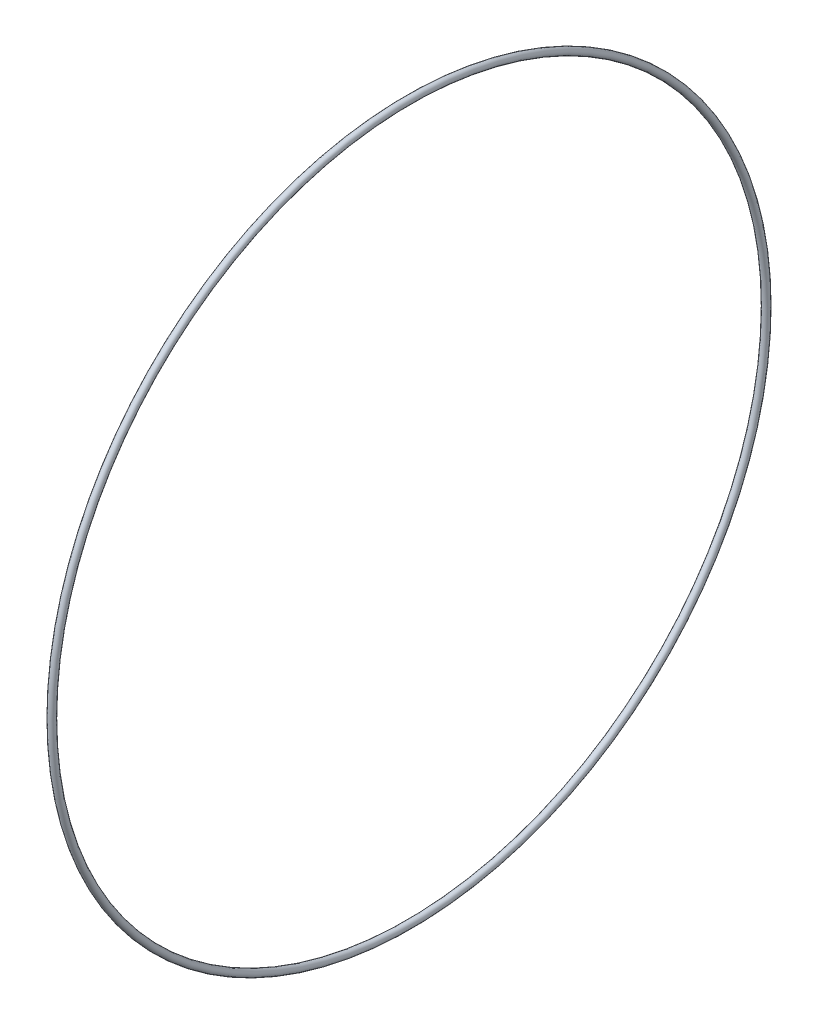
from build123d import *

# Parameters (mm, degrees)
ESQUISSE1_R = 0.5


with BuildPart() as part:
    # Esquisse1 → R_volution1 (revolve)
    with BuildSketch(Plane.XY, mode=Mode.PRIVATE) as r_volution1_sk:
        with Locations((8.5, 51.5)):
            Circle(ESQUISSE1_R)
    revolve(r_volution1_sk.sketch.rotate(Axis((0, 0, 0), (1, 0, 0)), 90), axis=Axis((0, 0, 0), (1, 0, 0)))


solid = part.part
